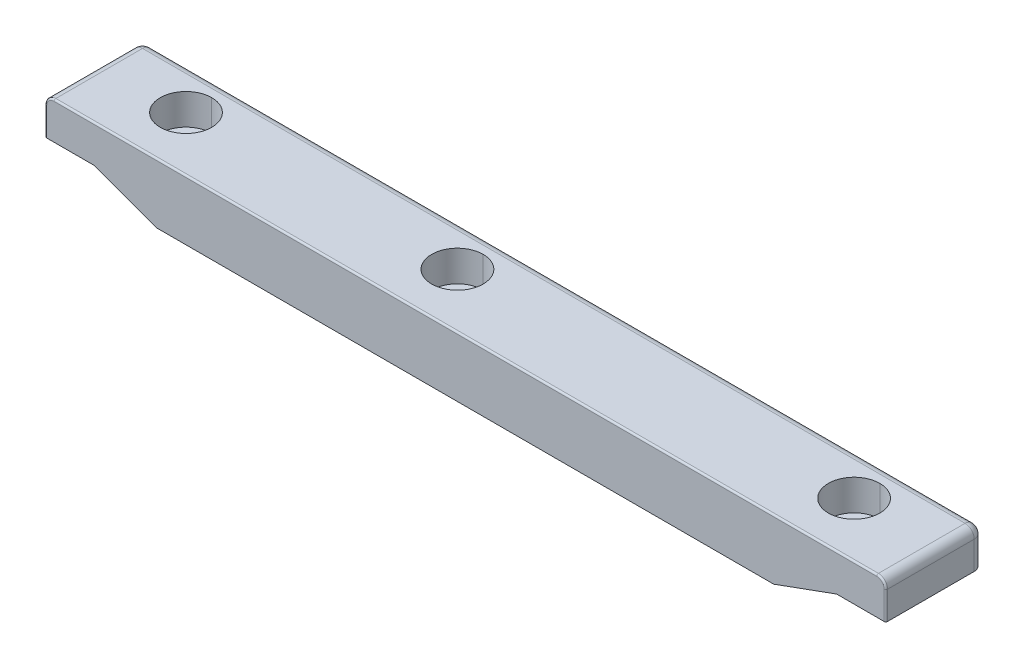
ISO-10303-21;
HEADER;
FILE_DESCRIPTION(('STEP AP214'),'2;1');
FILE_NAME('part.step','',(''),(''),'','','');
FILE_SCHEMA(('AUTOMOTIVE_DESIGN { 1 0 10303 214 1 1 1 1 }'));
ENDSEC;
DATA;
#1=APPLICATION_CONTEXT('core data for automotive mechanical design processes');
#2=APPLICATION_PROTOCOL_DEFINITION('international standard','automotive_design',2000,#1);
#3=PRODUCT_CONTEXT('',#1,'mechanical');
#4=PRODUCT('Part','Part','',(#3));
#5=PRODUCT_RELATED_PRODUCT_CATEGORY('part','',(#4));
#6=PRODUCT_DEFINITION_FORMATION('','',#4);
#7=PRODUCT_DEFINITION_CONTEXT('part definition',#1,'design');
#8=PRODUCT_DEFINITION('design','',#6,#7);
#9=PRODUCT_DEFINITION_SHAPE('','',#8);
#10=(LENGTH_UNIT() NAMED_UNIT(*) SI_UNIT(.MILLI.,.METRE.));
#11=(NAMED_UNIT(*) PLANE_ANGLE_UNIT() SI_UNIT($,.RADIAN.));
#12=(NAMED_UNIT(*) SI_UNIT($,.STERADIAN.) SOLID_ANGLE_UNIT());
#13=UNCERTAINTY_MEASURE_WITH_UNIT(LENGTH_MEASURE(1.E-05),#10,'distance_accuracy_value','');
#14=(GEOMETRIC_REPRESENTATION_CONTEXT(3) GLOBAL_UNCERTAINTY_ASSIGNED_CONTEXT((#13)) GLOBAL_UNIT_ASSIGNED_CONTEXT((#10,
#11,#12)) REPRESENTATION_CONTEXT('',''));
#15=CARTESIAN_POINT('',(0.,0.,0.));
#16=DIRECTION('',(0.,0.,1.));
#17=DIRECTION('',(1.,0.,0.));
#18=AXIS2_PLACEMENT_3D('',#15,#16,#17);
#19=CARTESIAN_POINT('',(-58.4,29.,7.5));
#20=DIRECTION('',(0.,1.,0.));
#21=DIRECTION('',(0.,0.,1.));
#22=AXIS2_PLACEMENT_3D('',#19,#20,#21);
#23=CYLINDRICAL_SURFACE('',#22,4.5);
#24=DIRECTION('',(0.,1.,0.));
#25=VECTOR('',#24,1.);
#26=CARTESIAN_POINT('',(-58.4,29.,3.));
#27=LINE('',#26,#25);
#28=CARTESIAN_POINT('',(-58.4,23.6,3.));
#29=VERTEX_POINT('',#28);
#30=CARTESIAN_POINT('',(-58.4,29.,3.));
#31=VERTEX_POINT('',#30);
#32=EDGE_CURVE('E587',#29,#31,#27,.T.);
#33=ORIENTED_EDGE('',*,*,#32,.F.);
#34=CARTESIAN_POINT('',(-58.4,23.6,7.5));
#35=DIRECTION('',(0.,1.,0.));
#36=DIRECTION('',(0.,0.,1.));
#37=AXIS2_PLACEMENT_3D('',#34,#35,#36);
#38=CIRCLE('',#37,4.5);
#39=CARTESIAN_POINT('',(-58.4,23.6,12.));
#40=VERTEX_POINT('',#39);
#41=EDGE_CURVE('E10',#40,#29,#38,.T.);
#42=ORIENTED_EDGE('',*,*,#41,.F.);
#43=DIRECTION('',(0.,1.,0.));
#44=VECTOR('',#43,1.);
#45=CARTESIAN_POINT('',(-58.4,29.,12.));
#46=LINE('',#45,#44);
#47=CARTESIAN_POINT('',(-58.4,29.,12.));
#48=VERTEX_POINT('',#47);
#49=EDGE_CURVE('E488',#40,#48,#46,.T.);
#50=ORIENTED_EDGE('',*,*,#49,.T.);
#51=CARTESIAN_POINT('',(-58.4,29.,7.5));
#52=DIRECTION('',(0.,1.,0.));
#53=DIRECTION('',(0.,0.,1.));
#54=AXIS2_PLACEMENT_3D('',#51,#52,#53);
#55=CIRCLE('',#54,4.5);
#56=EDGE_CURVE('E321',#48,#31,#55,.T.);
#57=ORIENTED_EDGE('',*,*,#56,.T.);
#58=EDGE_LOOP('',(#33,#42,#50,#57));
#59=FACE_BOUND('',#58,.T.);
#60=ADVANCED_FACE('F15',(#59),#23,.F.);
#61=CARTESIAN_POINT('',(-55.65,23.6,7.5));
#62=DIRECTION('',(0.,-1.,0.));
#63=DIRECTION('',(0.,0.,-1.));
#64=AXIS2_PLACEMENT_3D('',#61,#62,#63);
#65=PLANE('',#64);
#66=CARTESIAN_POINT('',(-58.4,23.6,7.5));
#67=DIRECTION('',(0.,1.,0.));
#68=DIRECTION('',(0.,0.,1.));
#69=AXIS2_PLACEMENT_3D('',#66,#67,#68);
#70=CIRCLE('',#69,2.75);
#71=CARTESIAN_POINT('',(-58.4,23.6,10.25));
#72=VERTEX_POINT('',#71);
#73=CARTESIAN_POINT('',(-58.4,23.6,4.75));
#74=VERTEX_POINT('',#73);
#75=EDGE_CURVE('E19',#72,#74,#70,.T.);
#76=ORIENTED_EDGE('',*,*,#75,.F.);
#77=CARTESIAN_POINT('',(-58.4,23.6,7.5));
#78=DIRECTION('',(0.,1.,0.));
#79=DIRECTION('',(0.,0.,1.));
#80=AXIS2_PLACEMENT_3D('',#77,#78,#79);
#81=CIRCLE('',#80,2.75);
#82=EDGE_CURVE('E475',#74,#72,#81,.T.);
#83=ORIENTED_EDGE('',*,*,#82,.F.);
#84=EDGE_LOOP('',(#76,#83));
#85=FACE_BOUND('',#84,.T.);
#86=ORIENTED_EDGE('',*,*,#41,.T.);
#87=CARTESIAN_POINT('',(-58.4,23.6,7.5));
#88=DIRECTION('',(0.,1.,0.));
#89=DIRECTION('',(0.,0.,1.));
#90=AXIS2_PLACEMENT_3D('',#87,#88,#89);
#91=CIRCLE('',#90,4.5);
#92=EDGE_CURVE('E1088',#29,#40,#91,.T.);
#93=ORIENTED_EDGE('',*,*,#92,.T.);
#94=EDGE_LOOP('',(#86,#93));
#95=FACE_BOUND('',#94,.T.);
#96=ADVANCED_FACE('F17',(#85,#95),#65,.F.);
#97=CARTESIAN_POINT('',(-58.4,29.,7.5));
#98=DIRECTION('',(0.,1.,0.));
#99=DIRECTION('',(0.,0.,1.));
#100=AXIS2_PLACEMENT_3D('',#97,#98,#99);
#101=CYLINDRICAL_SURFACE('',#100,2.75);
#102=DIRECTION('',(0.,1.,0.));
#103=VECTOR('',#102,1.);
#104=CARTESIAN_POINT('',(-58.4,29.,4.75));
#105=LINE('',#104,#103);
#106=CARTESIAN_POINT('',(-58.4,20.1484749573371,4.75));
#107=VERTEX_POINT('',#106);
#108=EDGE_CURVE('E469',#107,#74,#105,.T.);
#109=ORIENTED_EDGE('',*,*,#108,.F.);
#110=CARTESIAN_POINT('',(-58.4,20.1484749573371,10.25));
#111=CARTESIAN_POINT('',(-52.9,18.146638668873,10.25));
#112=CARTESIAN_POINT('',(-52.9,18.146638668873,4.75));
#113=CARTESIAN_POINT('',(-58.4,20.1484749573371,4.75));
#114=(BOUNDED_CURVE() B_SPLINE_CURVE(3,(#110,#111,#112,#113),.UNSPECIFIED.,.F.,
.F.) B_SPLINE_CURVE_WITH_KNOTS((4,4),(1.5707963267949,4.71238898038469),
.UNSPECIFIED.) CURVE() GEOMETRIC_REPRESENTATION_ITEM() RATIONAL_B_SPLINE_CURVE((1.,
0.333333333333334,0.333333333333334,1.)) REPRESENTATION_ITEM(''));
#115=CARTESIAN_POINT('',(-58.4,20.1484749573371,10.25));
#116=VERTEX_POINT('',#115);
#117=EDGE_CURVE('E430',#116,#107,#114,.T.);
#118=ORIENTED_EDGE('',*,*,#117,.F.);
#119=DIRECTION('',(0.,1.,0.));
#120=VECTOR('',#119,1.);
#121=CARTESIAN_POINT('',(-58.4,29.,10.25));
#122=LINE('',#121,#120);
#123=EDGE_CURVE('E472',#116,#72,#122,.T.);
#124=ORIENTED_EDGE('',*,*,#123,.T.);
#125=ORIENTED_EDGE('',*,*,#75,.T.);
#126=EDGE_LOOP('',(#109,#118,#124,#125));
#127=FACE_BOUND('',#126,.T.);
#128=ADVANCED_FACE('F467',(#127),#101,.F.);
#129=CARTESIAN_POINT('',(-10.95,29.,7.5));
#130=DIRECTION('',(0.,1.,0.));
#131=DIRECTION('',(0.,0.,1.));
#132=AXIS2_PLACEMENT_3D('',#129,#130,#131);
#133=CYLINDRICAL_SURFACE('',#132,4.5);
#134=DIRECTION('',(0.,1.,0.));
#135=VECTOR('',#134,1.);
#136=CARTESIAN_POINT('',(-10.95,29.,3.));
#137=LINE('',#136,#135);
#138=CARTESIAN_POINT('',(-10.95,23.6,3.));
#139=VERTEX_POINT('',#138);
#140=CARTESIAN_POINT('',(-10.95,29.,3.));
#141=VERTEX_POINT('',#140);
#142=EDGE_CURVE('E516',#139,#141,#137,.T.);
#143=ORIENTED_EDGE('',*,*,#142,.F.);
#144=CARTESIAN_POINT('',(-10.95,23.6,7.5));
#145=DIRECTION('',(0.,1.,0.));
#146=DIRECTION('',(0.,0.,1.));
#147=AXIS2_PLACEMENT_3D('',#144,#145,#146);
#148=CIRCLE('',#147,4.5);
#149=CARTESIAN_POINT('',(-10.95,23.6,12.));
#150=VERTEX_POINT('',#149);
#151=EDGE_CURVE('E453',#150,#139,#148,.T.);
#152=ORIENTED_EDGE('',*,*,#151,.F.);
#153=DIRECTION('',(0.,1.,0.));
#154=VECTOR('',#153,1.);
#155=CARTESIAN_POINT('',(-10.95,29.,12.));
#156=LINE('',#155,#154);
#157=CARTESIAN_POINT('',(-10.95,29.,12.));
#158=VERTEX_POINT('',#157);
#159=EDGE_CURVE('E519',#150,#158,#156,.T.);
#160=ORIENTED_EDGE('',*,*,#159,.T.);
#161=CARTESIAN_POINT('',(-10.95,29.,7.5));
#162=DIRECTION('',(0.,1.,0.));
#163=DIRECTION('',(0.,0.,1.));
#164=AXIS2_PLACEMENT_3D('',#161,#162,#163);
#165=CIRCLE('',#164,4.5);
#166=EDGE_CURVE('E328',#158,#141,#165,.T.);
#167=ORIENTED_EDGE('',*,*,#166,.T.);
#168=EDGE_LOOP('',(#143,#152,#160,#167));
#169=FACE_BOUND('',#168,.T.);
#170=ADVANCED_FACE('F756',(#169),#133,.F.);
#171=CARTESIAN_POINT('',(-8.2,23.6,7.5));
#172=DIRECTION('',(0.,-1.,0.));
#173=DIRECTION('',(0.,0.,-1.));
#174=AXIS2_PLACEMENT_3D('',#171,#172,#173);
#175=PLANE('',#174);
#176=CARTESIAN_POINT('',(-10.95,23.6,7.5));
#177=DIRECTION('',(0.,1.,0.));
#178=DIRECTION('',(0.,0.,1.));
#179=AXIS2_PLACEMENT_3D('',#176,#177,#178);
#180=CIRCLE('',#179,2.75);
#181=CARTESIAN_POINT('',(-10.95,23.6,10.25));
#182=VERTEX_POINT('',#181);
#183=CARTESIAN_POINT('',(-10.95,23.6,4.75));
#184=VERTEX_POINT('',#183);
#185=EDGE_CURVE('E448',#182,#184,#180,.T.);
#186=ORIENTED_EDGE('',*,*,#185,.F.);
#187=CARTESIAN_POINT('',(-10.95,23.6,7.5));
#188=DIRECTION('',(0.,1.,0.));
#189=DIRECTION('',(0.,0.,1.));
#190=AXIS2_PLACEMENT_3D('',#187,#188,#189);
#191=CIRCLE('',#190,2.75);
#192=EDGE_CURVE('E499',#184,#182,#191,.T.);
#193=ORIENTED_EDGE('',*,*,#192,.F.);
#194=EDGE_LOOP('',(#186,#193));
#195=FACE_BOUND('',#194,.T.);
#196=ORIENTED_EDGE('',*,*,#151,.T.);
#197=CARTESIAN_POINT('',(-10.95,23.6,7.5));
#198=DIRECTION('',(0.,1.,0.));
#199=DIRECTION('',(0.,0.,1.));
#200=AXIS2_PLACEMENT_3D('',#197,#198,#199);
#201=CIRCLE('',#200,4.5);
#202=EDGE_CURVE('E510',#139,#150,#201,.T.);
#203=ORIENTED_EDGE('',*,*,#202,.T.);
#204=EDGE_LOOP('',(#196,#203));
#205=FACE_BOUND('',#204,.T.);
#206=ADVANCED_FACE('F754',(#195,#205),#175,.F.);
#207=CARTESIAN_POINT('',(-10.95,29.,7.5));
#208=DIRECTION('',(0.,1.,0.));
#209=DIRECTION('',(0.,0.,1.));
#210=AXIS2_PLACEMENT_3D('',#207,#208,#209);
#211=CYLINDRICAL_SURFACE('',#210,2.75);
#212=DIRECTION('',(0.,1.,0.));
#213=VECTOR('',#212,1.);
#214=CARTESIAN_POINT('',(-10.95,29.,4.75));
#215=LINE('',#214,#213);
#216=CARTESIAN_POINT('',(-10.95,18.51,4.75));
#217=VERTEX_POINT('',#216);
#218=EDGE_CURVE('E495',#217,#184,#215,.T.);
#219=ORIENTED_EDGE('',*,*,#218,.F.);
#220=CARTESIAN_POINT('',(-10.95,18.51,7.5));
#221=DIRECTION('',(0.,1.,0.));
#222=DIRECTION('',(0.,0.,1.));
#223=AXIS2_PLACEMENT_3D('',#220,#221,#222);
#224=CIRCLE('',#223,2.75);
#225=CARTESIAN_POINT('',(-10.95,18.51,10.25));
#226=VERTEX_POINT('',#225);
#227=EDGE_CURVE('E441',#226,#217,#224,.T.);
#228=ORIENTED_EDGE('',*,*,#227,.F.);
#229=DIRECTION('',(0.,1.,0.));
#230=VECTOR('',#229,1.);
#231=CARTESIAN_POINT('',(-10.95,29.,10.25));
#232=LINE('',#231,#230);
#233=EDGE_CURVE('E507',#226,#182,#232,.T.);
#234=ORIENTED_EDGE('',*,*,#233,.T.);
#235=ORIENTED_EDGE('',*,*,#185,.T.);
#236=EDGE_LOOP('',(#219,#228,#234,#235));
#237=FACE_BOUND('',#236,.T.);
#238=ADVANCED_FACE('F750',(#237),#211,.F.);
#239=CARTESIAN_POINT('',(58.4,29.,7.5));
#240=DIRECTION('',(0.,1.,0.));
#241=DIRECTION('',(0.,0.,1.));
#242=AXIS2_PLACEMENT_3D('',#239,#240,#241);
#243=CYLINDRICAL_SURFACE('',#242,4.5);
#244=DIRECTION('',(0.,1.,0.));
#245=VECTOR('',#244,1.);
#246=CARTESIAN_POINT('',(58.4,29.,3.));
#247=LINE('',#246,#245);
#248=CARTESIAN_POINT('',(58.4,23.6,3.));
#249=VERTEX_POINT('',#248);
#250=CARTESIAN_POINT('',(58.4,29.,3.));
#251=VERTEX_POINT('',#250);
#252=EDGE_CURVE('E534',#249,#251,#247,.T.);
#253=ORIENTED_EDGE('',*,*,#252,.F.);
#254=CARTESIAN_POINT('',(58.4,23.6,7.5));
#255=DIRECTION('',(0.,1.,0.));
#256=DIRECTION('',(0.,0.,1.));
#257=AXIS2_PLACEMENT_3D('',#254,#255,#256);
#258=CIRCLE('',#257,4.5);
#259=CARTESIAN_POINT('',(58.4,23.6,12.));
#260=VERTEX_POINT('',#259);
#261=EDGE_CURVE('E391',#260,#249,#258,.T.);
#262=ORIENTED_EDGE('',*,*,#261,.F.);
#263=DIRECTION('',(0.,1.,0.));
#264=VECTOR('',#263,1.);
#265=CARTESIAN_POINT('',(58.4,29.,12.));
#266=LINE('',#265,#264);
#267=CARTESIAN_POINT('',(58.4,29.,12.));
#268=VERTEX_POINT('',#267);
#269=EDGE_CURVE('E545',#260,#268,#266,.T.);
#270=ORIENTED_EDGE('',*,*,#269,.T.);
#271=CARTESIAN_POINT('',(58.4,29.,7.5));
#272=DIRECTION('',(0.,1.,0.));
#273=DIRECTION('',(0.,0.,1.));
#274=AXIS2_PLACEMENT_3D('',#271,#272,#273);
#275=CIRCLE('',#274,4.5);
#276=EDGE_CURVE('E332',#268,#251,#275,.T.);
#277=ORIENTED_EDGE('',*,*,#276,.T.);
#278=EDGE_LOOP('',(#253,#262,#270,#277));
#279=FACE_BOUND('',#278,.T.);
#280=ADVANCED_FACE('F700',(#279),#243,.F.);
#281=CARTESIAN_POINT('',(61.15,23.6,7.5));
#282=DIRECTION('',(0.,-1.,0.));
#283=DIRECTION('',(0.,0.,-1.));
#284=AXIS2_PLACEMENT_3D('',#281,#282,#283);
#285=PLANE('',#284);
#286=CARTESIAN_POINT('',(58.4,23.6,7.5));
#287=DIRECTION('',(0.,1.,0.));
#288=DIRECTION('',(0.,0.,1.));
#289=AXIS2_PLACEMENT_3D('',#286,#287,#288);
#290=CIRCLE('',#289,2.75);
#291=CARTESIAN_POINT('',(58.4,23.6,10.25));
#292=VERTEX_POINT('',#291);
#293=CARTESIAN_POINT('',(58.4,23.6,4.75));
#294=VERTEX_POINT('',#293);
#295=EDGE_CURVE('E388',#292,#294,#290,.T.);
#296=ORIENTED_EDGE('',*,*,#295,.F.);
#297=CARTESIAN_POINT('',(58.4,23.6,7.5));
#298=DIRECTION('',(0.,1.,0.));
#299=DIRECTION('',(0.,0.,1.));
#300=AXIS2_PLACEMENT_3D('',#297,#298,#299);
#301=CIRCLE('',#300,2.75);
#302=EDGE_CURVE('E279',#294,#292,#301,.T.);
#303=ORIENTED_EDGE('',*,*,#302,.F.);
#304=EDGE_LOOP('',(#296,#303));
#305=FACE_BOUND('',#304,.T.);
#306=ORIENTED_EDGE('',*,*,#261,.T.);
#307=CARTESIAN_POINT('',(58.4,23.6,7.5));
#308=DIRECTION('',(0.,1.,0.));
#309=DIRECTION('',(0.,0.,1.));
#310=AXIS2_PLACEMENT_3D('',#307,#308,#309);
#311=CIRCLE('',#310,4.5);
#312=EDGE_CURVE('E530',#249,#260,#311,.T.);
#313=ORIENTED_EDGE('',*,*,#312,.T.);
#314=EDGE_LOOP('',(#306,#313));
#315=FACE_BOUND('',#314,.T.);
#316=ADVANCED_FACE('F564',(#305,#315),#285,.F.);
#317=CARTESIAN_POINT('',(58.4,29.,7.5));
#318=DIRECTION('',(0.,1.,0.));
#319=DIRECTION('',(0.,0.,1.));
#320=AXIS2_PLACEMENT_3D('',#317,#318,#319);
#321=CYLINDRICAL_SURFACE('',#320,2.75);
#322=DIRECTION('',(0.,1.,0.));
#323=VECTOR('',#322,1.);
#324=CARTESIAN_POINT('',(58.4,29.,4.75));
#325=LINE('',#324,#323);
#326=CARTESIAN_POINT('',(58.4,20.1484749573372,4.75));
#327=VERTEX_POINT('',#326);
#328=EDGE_CURVE('E550',#327,#294,#325,.T.);
#329=ORIENTED_EDGE('',*,*,#328,.F.);
#330=CARTESIAN_POINT('',(58.4,20.1484749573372,10.25));
#331=CARTESIAN_POINT('',(63.9,22.1503112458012,10.25));
#332=CARTESIAN_POINT('',(63.9,22.1503112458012,4.74999999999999));
#333=CARTESIAN_POINT('',(58.4,20.1484749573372,4.75));
#334=(BOUNDED_CURVE() B_SPLINE_CURVE(3,(#330,#331,#332,#333),.UNSPECIFIED.,.F.,
.F.) B_SPLINE_CURVE_WITH_KNOTS((4,4),(4.71238898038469,7.85398163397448),
.UNSPECIFIED.) CURVE() GEOMETRIC_REPRESENTATION_ITEM() RATIONAL_B_SPLINE_CURVE((1.,
0.333333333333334,0.333333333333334,1.)) REPRESENTATION_ITEM(''));
#335=CARTESIAN_POINT('',(58.4,20.1484749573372,10.25));
#336=VERTEX_POINT('',#335);
#337=EDGE_CURVE('E392',#336,#327,#334,.T.);
#338=ORIENTED_EDGE('',*,*,#337,.F.);
#339=DIRECTION('',(0.,1.,0.));
#340=VECTOR('',#339,1.);
#341=CARTESIAN_POINT('',(58.4,29.,10.25));
#342=LINE('',#341,#340);
#343=EDGE_CURVE('E273',#336,#292,#342,.T.);
#344=ORIENTED_EDGE('',*,*,#343,.T.);
#345=ORIENTED_EDGE('',*,*,#295,.T.);
#346=EDGE_LOOP('',(#329,#338,#344,#345));
#347=FACE_BOUND('',#346,.T.);
#348=ADVANCED_FACE('F567',(#347),#321,.F.);
#349=CARTESIAN_POINT('',(64.8865797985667,22.5093969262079,17.05));
#350=DIRECTION('',(-0.342020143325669,0.939692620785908,0.));
#351=DIRECTION('',(0.,0.,1.));
#352=AXIS2_PLACEMENT_3D('',#349,#350,#351);
#353=PLANE('',#352);
#354=ORIENTED_EDGE('',*,*,#337,.T.);
#355=CARTESIAN_POINT('',(58.4,20.1484749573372,4.75));
#356=CARTESIAN_POINT('',(52.9,18.146638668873,4.74999999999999));
#357=CARTESIAN_POINT('',(52.9,18.146638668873,10.25));
#358=CARTESIAN_POINT('',(58.4,20.1484749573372,10.25));
#359=(BOUNDED_CURVE() B_SPLINE_CURVE(3,(#355,#356,#357,#358),.UNSPECIFIED.,.F.,
.F.) B_SPLINE_CURVE_WITH_KNOTS((4,4),(1.5707963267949,4.71238898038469),
.UNSPECIFIED.) CURVE() GEOMETRIC_REPRESENTATION_ITEM() RATIONAL_B_SPLINE_CURVE((1.,
0.333333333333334,0.333333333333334,1.)) REPRESENTATION_ITEM(''));
#360=EDGE_CURVE('E549',#327,#336,#359,.T.);
#361=ORIENTED_EDGE('',*,*,#360,.T.);
#362=EDGE_LOOP('',(#354,#361));
#363=FACE_BOUND('',#362,.T.);
#364=DIRECTION('',(0.939692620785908,0.342020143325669,0.));
#365=VECTOR('',#364,1.);
#366=CARTESIAN_POINT('',(64.8865797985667,22.5093969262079,0.));
#367=LINE('',#366,#365);
#368=CARTESIAN_POINT('',(53.8983270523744,18.51,0.));
#369=VERTEX_POINT('',#368);
#370=CARTESIAN_POINT('',(64.8882367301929,22.51,0.));
#371=VERTEX_POINT('',#370);
#372=EDGE_CURVE('E387',#369,#371,#367,.T.);
#373=ORIENTED_EDGE('',*,*,#372,.T.);
#374=DIRECTION('',(0.,0.,-1.));
#375=VECTOR('',#374,1.);
#376=CARTESIAN_POINT('',(64.8882367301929,22.51,17.05));
#377=LINE('',#376,#375);
#378=CARTESIAN_POINT('',(64.8882367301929,22.51,17.05));
#379=VERTEX_POINT('',#378);
#380=EDGE_CURVE('E352',#379,#371,#377,.T.);
#381=ORIENTED_EDGE('',*,*,#380,.F.);
#382=DIRECTION('',(0.939692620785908,0.342020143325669,0.));
#383=VECTOR('',#382,1.);
#384=CARTESIAN_POINT('',(64.8865797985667,22.5093969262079,17.05));
#385=LINE('',#384,#383);
#386=CARTESIAN_POINT('',(53.8983270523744,18.51,17.05));
#387=VERTEX_POINT('',#386);
#388=EDGE_CURVE('E339',#387,#379,#385,.T.);
#389=ORIENTED_EDGE('',*,*,#388,.F.);
#390=DIRECTION('',(0.,0.,-1.));
#391=VECTOR('',#390,1.);
#392=CARTESIAN_POINT('',(53.8983270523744,18.51,17.05));
#393=LINE('',#392,#391);
#394=EDGE_CURVE('E435',#387,#369,#393,.T.);
#395=ORIENTED_EDGE('',*,*,#394,.T.);
#396=EDGE_LOOP('',(#373,#381,#389,#395));
#397=FACE_BOUND('',#396,.T.);
#398=ADVANCED_FACE('F569',(#363,#397),#353,.F.);
#399=CARTESIAN_POINT('',(53.9000903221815,18.51,17.05));
#400=DIRECTION('',(0.,1.,0.));
#401=DIRECTION('',(1.,0.,0.));
#402=AXIS2_PLACEMENT_3D('',#399,#400,#401);
#403=PLANE('',#402);
#404=ORIENTED_EDGE('',*,*,#227,.T.);
#405=CARTESIAN_POINT('',(-10.95,18.51,7.5));
#406=DIRECTION('',(0.,1.,0.));
#407=DIRECTION('',(0.,0.,1.));
#408=AXIS2_PLACEMENT_3D('',#405,#406,#407);
#409=CIRCLE('',#408,2.75);
#410=EDGE_CURVE('E500',#217,#226,#409,.T.);
#411=ORIENTED_EDGE('',*,*,#410,.T.);
#412=EDGE_LOOP('',(#404,#411));
#413=FACE_BOUND('',#412,.T.);
#414=DIRECTION('',(1.,0.,0.));
#415=VECTOR('',#414,1.);
#416=CARTESIAN_POINT('',(53.9000903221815,18.51,0.));
#417=LINE('',#416,#415);
#418=CARTESIAN_POINT('',(-53.8983270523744,18.51,0.));
#419=VERTEX_POINT('',#418);
#420=EDGE_CURVE('E396',#419,#369,#417,.T.);
#421=ORIENTED_EDGE('',*,*,#420,.T.);
#422=ORIENTED_EDGE('',*,*,#394,.F.);
#423=DIRECTION('',(1.,0.,0.));
#424=VECTOR('',#423,1.);
#425=CARTESIAN_POINT('',(53.9000903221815,18.51,17.05));
#426=LINE('',#425,#424);
#427=CARTESIAN_POINT('',(-53.8983270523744,18.51,17.05));
#428=VERTEX_POINT('',#427);
#429=EDGE_CURVE('E379',#428,#387,#426,.T.);
#430=ORIENTED_EDGE('',*,*,#429,.F.);
#431=DIRECTION('',(0.,0.,-1.));
#432=VECTOR('',#431,1.);
#433=CARTESIAN_POINT('',(-53.8983270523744,18.51,17.05));
#434=LINE('',#433,#432);
#435=EDGE_CURVE('E135',#428,#419,#434,.T.);
#436=ORIENTED_EDGE('',*,*,#435,.T.);
#437=EDGE_LOOP('',(#421,#422,#430,#436));
#438=FACE_BOUND('',#437,.T.);
#439=ADVANCED_FACE('F741',(#413,#438),#403,.F.);
#440=CARTESIAN_POINT('',(-64.8865797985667,22.5093969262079,17.05));
#441=DIRECTION('',(0.342020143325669,0.939692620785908,0.));
#442=DIRECTION('',(0.,0.,-1.));
#443=AXIS2_PLACEMENT_3D('',#440,#441,#442);
#444=PLANE('',#443);
#445=ORIENTED_EDGE('',*,*,#117,.T.);
#446=CARTESIAN_POINT('',(-58.4,20.1484749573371,4.75));
#447=CARTESIAN_POINT('',(-63.9,22.1503112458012,4.75));
#448=CARTESIAN_POINT('',(-63.9,22.1503112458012,10.25));
#449=CARTESIAN_POINT('',(-58.4,20.1484749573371,10.25));
#450=(BOUNDED_CURVE() B_SPLINE_CURVE(3,(#446,#447,#448,#449),.UNSPECIFIED.,.F.,
.F.) B_SPLINE_CURVE_WITH_KNOTS((4,4),(4.71238898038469,7.85398163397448),
.UNSPECIFIED.) CURVE() GEOMETRIC_REPRESENTATION_ITEM() RATIONAL_B_SPLINE_CURVE((1.,
0.333333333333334,0.333333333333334,1.)) REPRESENTATION_ITEM(''));
#451=EDGE_CURVE('E482',#107,#116,#450,.T.);
#452=ORIENTED_EDGE('',*,*,#451,.T.);
#453=EDGE_LOOP('',(#445,#452));
#454=FACE_BOUND('',#453,.T.);
#455=DIRECTION('',(0.939692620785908,-0.342020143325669,0.));
#456=VECTOR('',#455,1.);
#457=CARTESIAN_POINT('',(-64.8865797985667,22.5093969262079,0.));
#458=LINE('',#457,#456);
#459=CARTESIAN_POINT('',(-64.8882367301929,22.51,0.));
#460=VERTEX_POINT('',#459);
#461=EDGE_CURVE('E399',#460,#419,#458,.T.);
#462=ORIENTED_EDGE('',*,*,#461,.T.);
#463=ORIENTED_EDGE('',*,*,#435,.F.);
#464=DIRECTION('',(0.939692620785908,-0.342020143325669,0.));
#465=VECTOR('',#464,1.);
#466=CARTESIAN_POINT('',(-64.8865797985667,22.5093969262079,17.05));
#467=LINE('',#466,#465);
#468=CARTESIAN_POINT('',(-64.8882367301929,22.51,17.05));
#469=VERTEX_POINT('',#468);
#470=EDGE_CURVE('E375',#469,#428,#467,.T.);
#471=ORIENTED_EDGE('',*,*,#470,.F.);
#472=DIRECTION('',(0.,0.,-1.));
#473=VECTOR('',#472,1.);
#474=CARTESIAN_POINT('',(-64.8882367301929,22.51,17.05));
#475=LINE('',#474,#473);
#476=EDGE_CURVE('E145',#469,#460,#475,.T.);
#477=ORIENTED_EDGE('',*,*,#476,.T.);
#478=EDGE_LOOP('',(#462,#463,#471,#477));
#479=FACE_BOUND('',#478,.T.);
#480=ADVANCED_FACE('F668',(#454,#479),#444,.F.);
#481=CARTESIAN_POINT('',(-73.5,22.51,17.05));
#482=DIRECTION('',(0.,1.,0.));
#483=DIRECTION('',(1.,0.,0.));
#484=AXIS2_PLACEMENT_3D('',#481,#482,#483);
#485=PLANE('',#484);
#486=CARTESIAN_POINT('',(-71.9,22.51,1.6));
#487=DIRECTION('',(0.,-1.,0.));
#488=DIRECTION('',(0.,0.,1.));
#489=AXIS2_PLACEMENT_3D('',#486,#487,#488);
#490=CIRCLE('',#489,1.6);
#491=CARTESIAN_POINT('',(-73.5,22.51,1.6));
#492=VERTEX_POINT('',#491);
#493=CARTESIAN_POINT('',(-71.9,22.51,0.));
#494=VERTEX_POINT('',#493);
#495=EDGE_CURVE('E245',#492,#494,#490,.T.);
#496=ORIENTED_EDGE('',*,*,#495,.T.);
#497=DIRECTION('',(1.,0.,0.));
#498=VECTOR('',#497,1.);
#499=CARTESIAN_POINT('',(-73.5,22.51,0.));
#500=LINE('',#499,#498);
#501=EDGE_CURVE('E402',#494,#460,#500,.T.);
#502=ORIENTED_EDGE('',*,*,#501,.T.);
#503=ORIENTED_EDGE('',*,*,#476,.F.);
#504=DIRECTION('',(1.,0.,0.));
#505=VECTOR('',#504,1.);
#506=CARTESIAN_POINT('',(-73.5,22.51,17.05));
#507=LINE('',#506,#505);
#508=CARTESIAN_POINT('',(-73.2,22.51,17.05));
#509=VERTEX_POINT('',#508);
#510=EDGE_CURVE('E371',#509,#469,#507,.T.);
#511=ORIENTED_EDGE('',*,*,#510,.F.);
#512=CARTESIAN_POINT('',(-73.2,22.51,16.75));
#513=DIRECTION('',(0.,-1.,0.));
#514=DIRECTION('',(0.,0.,1.));
#515=AXIS2_PLACEMENT_3D('',#512,#513,#514);
#516=CIRCLE('',#515,0.3);
#517=CARTESIAN_POINT('',(-73.5,22.51,16.75));
#518=VERTEX_POINT('',#517);
#519=EDGE_CURVE('E261',#509,#518,#516,.T.);
#520=ORIENTED_EDGE('',*,*,#519,.T.);
#521=DIRECTION('',(0.,0.,-1.));
#522=VECTOR('',#521,1.);
#523=CARTESIAN_POINT('',(-73.5,22.51,17.05));
#524=LINE('',#523,#522);
#525=EDGE_CURVE('E258',#518,#492,#524,.T.);
#526=ORIENTED_EDGE('',*,*,#525,.T.);
#527=EDGE_LOOP('',(#496,#502,#503,#511,#520,#526));
#528=FACE_BOUND('',#527,.T.);
#529=ADVANCED_FACE('F259',(#528),#485,.F.);
#530=CARTESIAN_POINT('',(73.5,22.51,17.05));
#531=DIRECTION('',(0.,1.,0.));
#532=DIRECTION('',(1.,0.,0.));
#533=AXIS2_PLACEMENT_3D('',#530,#531,#532);
#534=PLANE('',#533);
#535=CARTESIAN_POINT('',(71.9,22.51,1.6));
#536=DIRECTION('',(0.,-1.,0.));
#537=DIRECTION('',(0.,0.,1.));
#538=AXIS2_PLACEMENT_3D('',#535,#536,#537);
#539=CIRCLE('',#538,1.6);
#540=CARTESIAN_POINT('',(71.9,22.51,0.));
#541=VERTEX_POINT('',#540);
#542=CARTESIAN_POINT('',(73.5,22.51,1.6));
#543=VERTEX_POINT('',#542);
#544=EDGE_CURVE('E322',#541,#543,#539,.T.);
#545=ORIENTED_EDGE('',*,*,#544,.T.);
#546=DIRECTION('',(0.,0.,-1.));
#547=VECTOR('',#546,1.);
#548=CARTESIAN_POINT('',(73.5,22.51,17.05));
#549=LINE('',#548,#547);
#550=CARTESIAN_POINT('',(73.5,22.51,16.75));
#551=VERTEX_POINT('',#550);
#552=EDGE_CURVE('E299',#551,#543,#549,.T.);
#553=ORIENTED_EDGE('',*,*,#552,.F.);
#554=CARTESIAN_POINT('',(73.2,22.51,16.75));
#555=DIRECTION('',(0.,-1.,0.));
#556=DIRECTION('',(0.,0.,1.));
#557=AXIS2_PLACEMENT_3D('',#554,#555,#556);
#558=CIRCLE('',#557,0.3);
#559=CARTESIAN_POINT('',(73.2,22.51,17.05));
#560=VERTEX_POINT('',#559);
#561=EDGE_CURVE('E340',#551,#560,#558,.T.);
#562=ORIENTED_EDGE('',*,*,#561,.T.);
#563=DIRECTION('',(1.,0.,0.));
#564=VECTOR('',#563,1.);
#565=CARTESIAN_POINT('',(73.5,22.51,17.05));
#566=LINE('',#565,#564);
#567=EDGE_CURVE('E344',#379,#560,#566,.T.);
#568=ORIENTED_EDGE('',*,*,#567,.F.);
#569=ORIENTED_EDGE('',*,*,#380,.T.);
#570=DIRECTION('',(1.,0.,0.));
#571=VECTOR('',#570,1.);
#572=CARTESIAN_POINT('',(73.5,22.51,0.));
#573=LINE('',#572,#571);
#574=EDGE_CURVE('E383',#371,#541,#573,.T.);
#575=ORIENTED_EDGE('',*,*,#574,.T.);
#576=EDGE_LOOP('',(#545,#553,#562,#568,#569,#575));
#577=FACE_BOUND('',#576,.T.);
#578=ADVANCED_FACE('F643',(#577),#534,.F.);
#579=CARTESIAN_POINT('',(71.9,27.4,16.75));
#580=DIRECTION('',(0.,0.,-1.));
#581=DIRECTION('',(-1.,0.,0.));
#582=AXIS2_PLACEMENT_3D('',#579,#580,#581);
#583=TOROIDAL_SURFACE('',#582,1.3,0.3);
#584=CARTESIAN_POINT('',(73.2,27.4,16.75));
#585=DIRECTION('',(0.,1.,0.));
#586=DIRECTION('',(0.,0.,1.));
#587=AXIS2_PLACEMENT_3D('',#584,#585,#586);
#588=CIRCLE('',#587,0.3);
#589=CARTESIAN_POINT('',(73.2,27.4,17.05));
#590=VERTEX_POINT('',#589);
#591=CARTESIAN_POINT('',(73.5,27.4,16.75));
#592=VERTEX_POINT('',#591);
#593=EDGE_CURVE('E343',#590,#592,#588,.T.);
#594=ORIENTED_EDGE('',*,*,#593,.T.);
#595=CARTESIAN_POINT('',(71.9,27.4,16.75));
#596=DIRECTION('',(0.,0.,-1.));
#597=DIRECTION('',(-1.,0.,0.));
#598=AXIS2_PLACEMENT_3D('',#595,#596,#597);
#599=CIRCLE('',#598,1.6);
#600=CARTESIAN_POINT('',(71.9,29.,16.75));
#601=VERTEX_POINT('',#600);
#602=EDGE_CURVE('E415',#601,#592,#599,.T.);
#603=ORIENTED_EDGE('',*,*,#602,.F.);
#604=CARTESIAN_POINT('',(71.9,28.7,16.75));
#605=DIRECTION('',(1.,0.,0.));
#606=DIRECTION('',(0.,0.,-1.));
#607=AXIS2_PLACEMENT_3D('',#604,#605,#606);
#608=CIRCLE('',#607,0.3);
#609=CARTESIAN_POINT('',(71.9,28.7,17.05));
#610=VERTEX_POINT('',#609);
#611=EDGE_CURVE('E349',#601,#610,#608,.T.);
#612=ORIENTED_EDGE('',*,*,#611,.T.);
#613=CARTESIAN_POINT('',(71.9,27.4,17.05));
#614=DIRECTION('',(0.,0.,1.));
#615=DIRECTION('',(-1.,0.,0.));
#616=AXIS2_PLACEMENT_3D('',#613,#614,#615);
#617=CIRCLE('',#616,1.3);
#618=EDGE_CURVE('E353',#590,#610,#617,.T.);
#619=ORIENTED_EDGE('',*,*,#618,.F.);
#620=EDGE_LOOP('',(#594,#603,#612,#619));
#621=FACE_BOUND('',#620,.T.);
#622=ADVANCED_FACE('F624',(#621),#583,.T.);
#623=CARTESIAN_POINT('',(0.,28.7,16.75));
#624=DIRECTION('',(-1.,0.,0.));
#625=DIRECTION('',(0.,-1.,0.));
#626=AXIS2_PLACEMENT_3D('',#623,#624,#625);
#627=CYLINDRICAL_SURFACE('',#626,0.3);
#628=CARTESIAN_POINT('',(-71.9,28.7,16.75));
#629=DIRECTION('',(1.,0.,0.));
#630=DIRECTION('',(0.,0.,-1.));
#631=AXIS2_PLACEMENT_3D('',#628,#629,#630);
#632=CIRCLE('',#631,0.3);
#633=CARTESIAN_POINT('',(-71.9,29.,16.75));
#634=VERTEX_POINT('',#633);
#635=CARTESIAN_POINT('',(-71.9,28.7,17.05));
#636=VERTEX_POINT('',#635);
#637=EDGE_CURVE('E336',#634,#636,#632,.T.);
#638=ORIENTED_EDGE('',*,*,#637,.T.);
#639=DIRECTION('',(-1.,0.,0.));
#640=VECTOR('',#639,1.);
#641=CARTESIAN_POINT('',(0.,28.7,17.05));
#642=LINE('',#641,#640);
#643=EDGE_CURVE('E357',#610,#636,#642,.T.);
#644=ORIENTED_EDGE('',*,*,#643,.F.);
#645=ORIENTED_EDGE('',*,*,#611,.F.);
#646=DIRECTION('',(1.,0.,0.));
#647=VECTOR('',#646,1.);
#648=CARTESIAN_POINT('',(73.5,29.,16.75));
#649=LINE('',#648,#647);
#650=EDGE_CURVE('E308',#634,#601,#649,.T.);
#651=ORIENTED_EDGE('',*,*,#650,.F.);
#652=EDGE_LOOP('',(#638,#644,#645,#651));
#653=FACE_BOUND('',#652,.T.);
#654=ADVANCED_FACE('F656',(#653),#627,.T.);
#655=CARTESIAN_POINT('',(73.2,0.,16.75));
#656=DIRECTION('',(0.,1.,0.));
#657=DIRECTION('',(-1.,0.,0.));
#658=AXIS2_PLACEMENT_3D('',#655,#656,#657);
#659=CYLINDRICAL_SURFACE('',#658,0.299999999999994);
#660=ORIENTED_EDGE('',*,*,#561,.F.);
#661=DIRECTION('',(0.,-1.,0.));
#662=VECTOR('',#661,1.);
#663=CARTESIAN_POINT('',(73.5,29.,16.75));
#664=LINE('',#663,#662);
#665=EDGE_CURVE('E295',#592,#551,#664,.T.);
#666=ORIENTED_EDGE('',*,*,#665,.F.);
#667=ORIENTED_EDGE('',*,*,#593,.F.);
#668=DIRECTION('',(0.,1.,0.));
#669=VECTOR('',#668,1.);
#670=CARTESIAN_POINT('',(73.2,0.,17.05));
#671=LINE('',#670,#669);
#672=EDGE_CURVE('E348',#560,#590,#671,.T.);
#673=ORIENTED_EDGE('',*,*,#672,.F.);
#674=EDGE_LOOP('',(#660,#666,#667,#673));
#675=FACE_BOUND('',#674,.T.);
#676=ADVANCED_FACE('F639',(#675),#659,.T.);
#677=CARTESIAN_POINT('',(-71.9,27.4,16.75));
#678=DIRECTION('',(0.,0.,-1.));
#679=DIRECTION('',(-1.,0.,0.));
#680=AXIS2_PLACEMENT_3D('',#677,#678,#679);
#681=TOROIDAL_SURFACE('',#680,1.3,0.3);
#682=CARTESIAN_POINT('',(-73.2,27.4,16.75));
#683=DIRECTION('',(0.,1.,0.));
#684=DIRECTION('',(0.,0.,1.));
#685=AXIS2_PLACEMENT_3D('',#682,#683,#684);
#686=CIRCLE('',#685,0.3);
#687=CARTESIAN_POINT('',(-73.5,27.4,16.75));
#688=VERTEX_POINT('',#687);
#689=CARTESIAN_POINT('',(-73.2,27.4,17.05));
#690=VERTEX_POINT('',#689);
#691=EDGE_CURVE('E333',#688,#690,#686,.T.);
#692=ORIENTED_EDGE('',*,*,#691,.T.);
#693=CARTESIAN_POINT('',(-71.9,27.4,17.05));
#694=DIRECTION('',(0.,0.,1.));
#695=DIRECTION('',(-1.,0.,0.));
#696=AXIS2_PLACEMENT_3D('',#693,#694,#695);
#697=CIRCLE('',#696,1.3);
#698=EDGE_CURVE('E361',#636,#690,#697,.T.);
#699=ORIENTED_EDGE('',*,*,#698,.F.);
#700=ORIENTED_EDGE('',*,*,#637,.F.);
#701=CARTESIAN_POINT('',(-71.9,27.4,16.75));
#702=DIRECTION('',(0.,0.,-1.));
#703=DIRECTION('',(-1.,0.,0.));
#704=AXIS2_PLACEMENT_3D('',#701,#702,#703);
#705=CIRCLE('',#704,1.6);
#706=EDGE_CURVE('E290',#688,#634,#705,.T.);
#707=ORIENTED_EDGE('',*,*,#706,.F.);
#708=EDGE_LOOP('',(#692,#699,#700,#707));
#709=FACE_BOUND('',#708,.T.);
#710=ADVANCED_FACE('F675',(#709),#681,.T.);
#711=CARTESIAN_POINT('',(-73.2,0.,16.75));
#712=DIRECTION('',(0.,-1.,0.));
#713=DIRECTION('',(1.,0.,0.));
#714=AXIS2_PLACEMENT_3D('',#711,#712,#713);
#715=CYLINDRICAL_SURFACE('',#714,0.299999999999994);
#716=ORIENTED_EDGE('',*,*,#519,.F.);
#717=DIRECTION('',(0.,-1.,0.));
#718=VECTOR('',#717,1.);
#719=CARTESIAN_POINT('',(-73.2,0.,17.05));
#720=LINE('',#719,#718);
#721=EDGE_CURVE('E365',#690,#509,#720,.T.);
#722=ORIENTED_EDGE('',*,*,#721,.F.);
#723=ORIENTED_EDGE('',*,*,#691,.F.);
#724=DIRECTION('',(0.,1.,0.));
#725=VECTOR('',#724,1.);
#726=CARTESIAN_POINT('',(-73.5,29.,16.75));
#727=LINE('',#726,#725);
#728=EDGE_CURVE('E266',#518,#688,#727,.T.);
#729=ORIENTED_EDGE('',*,*,#728,.F.);
#730=EDGE_LOOP('',(#716,#722,#723,#729));
#731=FACE_BOUND('',#730,.T.);
#732=ADVANCED_FACE('F671',(#731),#715,.T.);
#733=CARTESIAN_POINT('',(71.9,29.,1.6));
#734=DIRECTION('',(0.,-1.,0.));
#735=DIRECTION('',(1.,0.,0.));
#736=AXIS2_PLACEMENT_3D('',#733,#734,#735);
#737=CYLINDRICAL_SURFACE('',#736,1.6);
#738=ORIENTED_EDGE('',*,*,#544,.F.);
#739=DIRECTION('',(0.,-1.,0.));
#740=VECTOR('',#739,1.);
#741=CARTESIAN_POINT('',(71.9,-29.,0.));
#742=LINE('',#741,#740);
#743=CARTESIAN_POINT('',(71.9,27.4,0.));
#744=VERTEX_POINT('',#743);
#745=EDGE_CURVE('E285',#744,#541,#742,.T.);
#746=ORIENTED_EDGE('',*,*,#745,.F.);
#747=CARTESIAN_POINT('',(71.9,27.4,1.6));
#748=DIRECTION('',(0.,-1.,0.));
#749=DIRECTION('',(0.,0.,1.));
#750=AXIS2_PLACEMENT_3D('',#747,#748,#749);
#751=CIRCLE('',#750,1.6);
#752=CARTESIAN_POINT('',(73.5,27.4,1.6));
#753=VERTEX_POINT('',#752);
#754=EDGE_CURVE('E39',#744,#753,#751,.T.);
#755=ORIENTED_EDGE('',*,*,#754,.T.);
#756=DIRECTION('',(0.,1.,0.));
#757=VECTOR('',#756,1.);
#758=CARTESIAN_POINT('',(73.5,29.,1.6));
#759=LINE('',#758,#757);
#760=EDGE_CURVE('E303',#543,#753,#759,.T.);
#761=ORIENTED_EDGE('',*,*,#760,.F.);
#762=EDGE_LOOP('',(#738,#746,#755,#761));
#763=FACE_BOUND('',#762,.T.);
#764=ADVANCED_FACE('F647',(#763),#737,.T.);
#765=CARTESIAN_POINT('',(71.9,27.4,1.6));
#766=DIRECTION('',(0.,1.,0.));
#767=DIRECTION('',(1.,0.,0.));
#768=AXIS2_PLACEMENT_3D('',#765,#766,#767);
#769=SPHERICAL_SURFACE('',#768,1.6);
#770=CARTESIAN_POINT('',(71.9,27.4,1.6));
#771=DIRECTION('',(1.,0.,0.));
#772=DIRECTION('',(0.,0.,-1.));
#773=AXIS2_PLACEMENT_3D('',#770,#771,#772);
#774=CIRCLE('',#773,1.6);
#775=CARTESIAN_POINT('',(71.9,29.,1.6));
#776=VERTEX_POINT('',#775);
#777=EDGE_CURVE('E255',#744,#776,#774,.T.);
#778=ORIENTED_EDGE('',*,*,#777,.T.);
#779=CARTESIAN_POINT('',(71.9,27.4,1.6));
#780=DIRECTION('',(0.,0.,-1.));
#781=DIRECTION('',(-1.,0.,0.));
#782=AXIS2_PLACEMENT_3D('',#779,#780,#781);
#783=CIRCLE('',#782,1.6);
#784=EDGE_CURVE('E419',#776,#753,#783,.T.);
#785=ORIENTED_EDGE('',*,*,#784,.T.);
#786=ORIENTED_EDGE('',*,*,#754,.F.);
#787=EDGE_LOOP('',(#778,#785,#786));
#788=FACE_BOUND('',#787,.T.);
#789=ADVANCED_FACE('F648',(#788),#769,.T.);
#790=CARTESIAN_POINT('',(-71.9,29.,1.6));
#791=DIRECTION('',(0.,1.,0.));
#792=DIRECTION('',(-1.,0.,0.));
#793=AXIS2_PLACEMENT_3D('',#790,#791,#792);
#794=CYLINDRICAL_SURFACE('',#793,1.6);
#795=ORIENTED_EDGE('',*,*,#495,.F.);
#796=DIRECTION('',(0.,-1.,0.));
#797=VECTOR('',#796,1.);
#798=CARTESIAN_POINT('',(-73.5,-29.,1.6));
#799=LINE('',#798,#797);
#800=CARTESIAN_POINT('',(-73.5,27.4,1.6));
#801=VERTEX_POINT('',#800);
#802=EDGE_CURVE('E249',#801,#492,#799,.T.);
#803=ORIENTED_EDGE('',*,*,#802,.F.);
#804=CARTESIAN_POINT('',(-71.9,27.4,1.6));
#805=DIRECTION('',(0.,-1.,0.));
#806=DIRECTION('',(0.,0.,1.));
#807=AXIS2_PLACEMENT_3D('',#804,#805,#806);
#808=CIRCLE('',#807,1.6);
#809=CARTESIAN_POINT('',(-71.9,27.4,0.));
#810=VERTEX_POINT('',#809);
#811=EDGE_CURVE('E238',#801,#810,#808,.T.);
#812=ORIENTED_EDGE('',*,*,#811,.T.);
#813=DIRECTION('',(0.,1.,0.));
#814=VECTOR('',#813,1.);
#815=CARTESIAN_POINT('',(-71.9,29.,0.));
#816=LINE('',#815,#814);
#817=EDGE_CURVE('E251',#494,#810,#816,.T.);
#818=ORIENTED_EDGE('',*,*,#817,.F.);
#819=EDGE_LOOP('',(#795,#803,#812,#818));
#820=FACE_BOUND('',#819,.T.);
#821=ADVANCED_FACE('F247',(#820),#794,.T.);
#822=CARTESIAN_POINT('',(73.5,27.4,1.6));
#823=DIRECTION('',(1.,0.,0.));
#824=DIRECTION('',(0.,1.,0.));
#825=AXIS2_PLACEMENT_3D('',#822,#823,#824);
#826=CYLINDRICAL_SURFACE('',#825,1.6);
#827=CARTESIAN_POINT('',(-71.9,27.4,1.6));
#828=DIRECTION('',(1.,0.,0.));
#829=DIRECTION('',(0.,0.,1.));
#830=AXIS2_PLACEMENT_3D('',#827,#828,#829);
#831=CIRCLE('',#830,1.6);
#832=CARTESIAN_POINT('',(-71.9,29.,1.6));
#833=VERTEX_POINT('',#832);
#834=EDGE_CURVE('E412',#810,#833,#831,.T.);
#835=ORIENTED_EDGE('',*,*,#834,.T.);
#836=DIRECTION('',(-1.,0.,0.));
#837=VECTOR('',#836,1.);
#838=CARTESIAN_POINT('',(-73.5,29.,1.6));
#839=LINE('',#838,#837);
#840=EDGE_CURVE('E317',#776,#833,#839,.T.);
#841=ORIENTED_EDGE('',*,*,#840,.F.);
#842=ORIENTED_EDGE('',*,*,#777,.F.);
#843=DIRECTION('',(1.,0.,0.));
#844=VECTOR('',#843,1.);
#845=CARTESIAN_POINT('',(73.5,27.4,0.));
#846=LINE('',#845,#844);
#847=EDGE_CURVE('E283',#810,#744,#846,.T.);
#848=ORIENTED_EDGE('',*,*,#847,.F.);
#849=EDGE_LOOP('',(#835,#841,#842,#848));
#850=FACE_BOUND('',#849,.T.);
#851=ADVANCED_FACE('F651',(#850),#826,.T.);
#852=CARTESIAN_POINT('',(71.9,27.4,17.05));
#853=DIRECTION('',(0.,0.,-1.));
#854=DIRECTION('',(-1.,0.,0.));
#855=AXIS2_PLACEMENT_3D('',#852,#853,#854);
#856=CYLINDRICAL_SURFACE('',#855,1.6);
#857=DIRECTION('',(0.,0.,-1.));
#858=VECTOR('',#857,1.);
#859=CARTESIAN_POINT('',(71.9,29.,17.05));
#860=LINE('',#859,#858);
#861=EDGE_CURVE('E312',#601,#776,#860,.T.);
#862=ORIENTED_EDGE('',*,*,#861,.F.);
#863=ORIENTED_EDGE('',*,*,#602,.T.);
#864=DIRECTION('',(0.,0.,1.));
#865=VECTOR('',#864,1.);
#866=CARTESIAN_POINT('',(73.5,27.4,17.05));
#867=LINE('',#866,#865);
#868=EDGE_CURVE('E307',#753,#592,#867,.T.);
#869=ORIENTED_EDGE('',*,*,#868,.F.);
#870=ORIENTED_EDGE('',*,*,#784,.F.);
#871=EDGE_LOOP('',(#862,#863,#869,#870));
#872=FACE_BOUND('',#871,.T.);
#873=ADVANCED_FACE('F632',(#872),#856,.T.);
#874=CARTESIAN_POINT('',(-71.9,27.4,1.6));
#875=DIRECTION('',(0.,1.,0.));
#876=DIRECTION('',(1.,0.,0.));
#877=AXIS2_PLACEMENT_3D('',#874,#875,#876);
#878=SPHERICAL_SURFACE('',#877,1.6);
#879=ORIENTED_EDGE('',*,*,#811,.F.);
#880=CARTESIAN_POINT('',(-71.9,27.4,1.6));
#881=DIRECTION('',(0.,0.,-1.));
#882=DIRECTION('',(-1.,0.,0.));
#883=AXIS2_PLACEMENT_3D('',#880,#881,#882);
#884=CIRCLE('',#883,1.6);
#885=EDGE_CURVE('E407',#801,#833,#884,.T.);
#886=ORIENTED_EDGE('',*,*,#885,.T.);
#887=ORIENTED_EDGE('',*,*,#834,.F.);
#888=EDGE_LOOP('',(#879,#886,#887));
#889=FACE_BOUND('',#888,.T.);
#890=ADVANCED_FACE('F679',(#889),#878,.T.);
#891=CARTESIAN_POINT('',(-71.9,27.4,17.05));
#892=DIRECTION('',(0.,0.,-1.));
#893=DIRECTION('',(-1.,0.,0.));
#894=AXIS2_PLACEMENT_3D('',#891,#892,#893);
#895=CYLINDRICAL_SURFACE('',#894,1.6);
#896=DIRECTION('',(0.,0.,-1.));
#897=VECTOR('',#896,1.);
#898=CARTESIAN_POINT('',(-73.5,27.4,17.05));
#899=LINE('',#898,#897);
#900=EDGE_CURVE('E271',#688,#801,#899,.T.);
#901=ORIENTED_EDGE('',*,*,#900,.F.);
#902=ORIENTED_EDGE('',*,*,#706,.T.);
#903=DIRECTION('',(0.,0.,1.));
#904=VECTOR('',#903,1.);
#905=CARTESIAN_POINT('',(-71.9,29.,17.05));
#906=LINE('',#905,#904);
#907=EDGE_CURVE('E313',#833,#634,#906,.T.);
#908=ORIENTED_EDGE('',*,*,#907,.F.);
#909=ORIENTED_EDGE('',*,*,#885,.F.);
#910=EDGE_LOOP('',(#901,#902,#908,#909));
#911=FACE_BOUND('',#910,.T.);
#912=ADVANCED_FACE('F678',(#911),#895,.T.);
#913=CARTESIAN_POINT('',(0.,0.,0.));
#914=DIRECTION('',(0.,0.,-1.));
#915=DIRECTION('',(0.,-1.,0.));
#916=AXIS2_PLACEMENT_3D('',#913,#914,#915);
#917=PLANE('',#916);
#918=ORIENTED_EDGE('',*,*,#574,.F.);
#919=ORIENTED_EDGE('',*,*,#372,.F.);
#920=ORIENTED_EDGE('',*,*,#420,.F.);
#921=ORIENTED_EDGE('',*,*,#461,.F.);
#922=ORIENTED_EDGE('',*,*,#501,.F.);
#923=ORIENTED_EDGE('',*,*,#817,.T.);
#924=ORIENTED_EDGE('',*,*,#847,.T.);
#925=ORIENTED_EDGE('',*,*,#745,.T.);
#926=EDGE_LOOP('',(#918,#919,#920,#921,#922,#923,#924,#925));
#927=FACE_BOUND('',#926,.T.);
#928=ADVANCED_FACE('F666',(#927),#917,.T.);
#929=CARTESIAN_POINT('',(0.,0.,17.05));
#930=DIRECTION('',(0.,0.,-1.));
#931=DIRECTION('',(0.,-1.,0.));
#932=AXIS2_PLACEMENT_3D('',#929,#930,#931);
#933=PLANE('',#932);
#934=ORIENTED_EDGE('',*,*,#388,.T.);
#935=ORIENTED_EDGE('',*,*,#567,.T.);
#936=ORIENTED_EDGE('',*,*,#672,.T.);
#937=ORIENTED_EDGE('',*,*,#618,.T.);
#938=ORIENTED_EDGE('',*,*,#643,.T.);
#939=ORIENTED_EDGE('',*,*,#698,.T.);
#940=ORIENTED_EDGE('',*,*,#721,.T.);
#941=ORIENTED_EDGE('',*,*,#510,.T.);
#942=ORIENTED_EDGE('',*,*,#470,.T.);
#943=ORIENTED_EDGE('',*,*,#429,.T.);
#944=EDGE_LOOP('',(#934,#935,#936,#937,#938,#939,#940,#941,#942,#943));
#945=FACE_BOUND('',#944,.T.);
#946=ADVANCED_FACE('F661',(#945),#933,.F.);
#947=CARTESIAN_POINT('',(73.5,29.,17.05));
#948=DIRECTION('',(0.,-1.,0.));
#949=DIRECTION('',(0.,0.,-1.));
#950=AXIS2_PLACEMENT_3D('',#947,#948,#949);
#951=PLANE('',#950);
#952=ORIENTED_EDGE('',*,*,#276,.F.);
#953=CARTESIAN_POINT('',(58.4,29.,7.5));
#954=DIRECTION('',(0.,1.,0.));
#955=DIRECTION('',(0.,0.,1.));
#956=AXIS2_PLACEMENT_3D('',#953,#954,#955);
#957=CIRCLE('',#956,4.5);
#958=EDGE_CURVE('E541',#251,#268,#957,.T.);
#959=ORIENTED_EDGE('',*,*,#958,.F.);
#960=EDGE_LOOP('',(#952,#959));
#961=FACE_BOUND('',#960,.T.);
#962=ORIENTED_EDGE('',*,*,#166,.F.);
#963=CARTESIAN_POINT('',(-10.95,29.,7.5));
#964=DIRECTION('',(0.,1.,0.));
#965=DIRECTION('',(0.,0.,1.));
#966=AXIS2_PLACEMENT_3D('',#963,#964,#965);
#967=CIRCLE('',#966,4.5);
#968=EDGE_CURVE('E523',#141,#158,#967,.T.);
#969=ORIENTED_EDGE('',*,*,#968,.F.);
#970=EDGE_LOOP('',(#962,#969));
#971=FACE_BOUND('',#970,.T.);
#972=ORIENTED_EDGE('',*,*,#56,.F.);
#973=CARTESIAN_POINT('',(-58.4,29.,7.5));
#974=DIRECTION('',(0.,1.,0.));
#975=DIRECTION('',(0.,0.,1.));
#976=AXIS2_PLACEMENT_3D('',#973,#974,#975);
#977=CIRCLE('',#976,4.5);
#978=EDGE_CURVE('E581',#31,#48,#977,.T.);
#979=ORIENTED_EDGE('',*,*,#978,.F.);
#980=EDGE_LOOP('',(#972,#979));
#981=FACE_BOUND('',#980,.T.);
#982=ORIENTED_EDGE('',*,*,#907,.T.);
#983=ORIENTED_EDGE('',*,*,#650,.T.);
#984=ORIENTED_EDGE('',*,*,#861,.T.);
#985=ORIENTED_EDGE('',*,*,#840,.T.);
#986=EDGE_LOOP('',(#982,#983,#984,#985));
#987=FACE_BOUND('',#986,.T.);
#988=ADVANCED_FACE('F607',(#961,#971,#981,#987),#951,.F.);
#989=CARTESIAN_POINT('',(73.5,29.,17.05));
#990=DIRECTION('',(-1.,0.,0.));
#991=DIRECTION('',(0.,1.,0.));
#992=AXIS2_PLACEMENT_3D('',#989,#990,#991);
#993=PLANE('',#992);
#994=ORIENTED_EDGE('',*,*,#665,.T.);
#995=ORIENTED_EDGE('',*,*,#552,.T.);
#996=ORIENTED_EDGE('',*,*,#760,.T.);
#997=ORIENTED_EDGE('',*,*,#868,.T.);
#998=EDGE_LOOP('',(#994,#995,#996,#997));
#999=FACE_BOUND('',#998,.T.);
#1000=ADVANCED_FACE('F635',(#999),#993,.F.);
#1001=CARTESIAN_POINT('',(-73.5,29.,17.05));
#1002=DIRECTION('',(1.,0.,0.));
#1003=DIRECTION('',(0.,1.,0.));
#1004=AXIS2_PLACEMENT_3D('',#1001,#1002,#1003);
#1005=PLANE('',#1004);
#1006=ORIENTED_EDGE('',*,*,#802,.T.);
#1007=ORIENTED_EDGE('',*,*,#525,.F.);
#1008=ORIENTED_EDGE('',*,*,#728,.T.);
#1009=ORIENTED_EDGE('',*,*,#900,.T.);
#1010=EDGE_LOOP('',(#1006,#1007,#1008,#1009));
#1011=FACE_BOUND('',#1010,.T.);
#1012=ADVANCED_FACE('F269',(#1011),#1005,.F.);
#1013=CARTESIAN_POINT('',(58.4,29.,7.5));
#1014=DIRECTION('',(0.,1.,0.));
#1015=DIRECTION('',(0.,0.,1.));
#1016=AXIS2_PLACEMENT_3D('',#1013,#1014,#1015);
#1017=CYLINDRICAL_SURFACE('',#1016,2.75);
#1018=ORIENTED_EDGE('',*,*,#360,.F.);
#1019=ORIENTED_EDGE('',*,*,#328,.T.);
#1020=ORIENTED_EDGE('',*,*,#302,.T.);
#1021=ORIENTED_EDGE('',*,*,#343,.F.);
#1022=EDGE_LOOP('',(#1018,#1019,#1020,#1021));
#1023=FACE_BOUND('',#1022,.T.);
#1024=ADVANCED_FACE('F560',(#1023),#1017,.F.);
#1025=CARTESIAN_POINT('',(58.4,29.,7.5));
#1026=DIRECTION('',(0.,1.,0.));
#1027=DIRECTION('',(0.,0.,1.));
#1028=AXIS2_PLACEMENT_3D('',#1025,#1026,#1027);
#1029=CYLINDRICAL_SURFACE('',#1028,4.5);
#1030=ORIENTED_EDGE('',*,*,#312,.F.);
#1031=ORIENTED_EDGE('',*,*,#252,.T.);
#1032=ORIENTED_EDGE('',*,*,#958,.T.);
#1033=ORIENTED_EDGE('',*,*,#269,.F.);
#1034=EDGE_LOOP('',(#1030,#1031,#1032,#1033));
#1035=FACE_BOUND('',#1034,.T.);
#1036=ADVANCED_FACE('F703',(#1035),#1029,.F.);
#1037=CARTESIAN_POINT('',(-10.95,29.,7.5));
#1038=DIRECTION('',(0.,1.,0.));
#1039=DIRECTION('',(0.,0.,1.));
#1040=AXIS2_PLACEMENT_3D('',#1037,#1038,#1039);
#1041=CYLINDRICAL_SURFACE('',#1040,2.75);
#1042=ORIENTED_EDGE('',*,*,#410,.F.);
#1043=ORIENTED_EDGE('',*,*,#218,.T.);
#1044=ORIENTED_EDGE('',*,*,#192,.T.);
#1045=ORIENTED_EDGE('',*,*,#233,.F.);
#1046=EDGE_LOOP('',(#1042,#1043,#1044,#1045));
#1047=FACE_BOUND('',#1046,.T.);
#1048=ADVANCED_FACE('F927',(#1047),#1041,.F.);
#1049=CARTESIAN_POINT('',(-10.95,29.,7.5));
#1050=DIRECTION('',(0.,1.,0.));
#1051=DIRECTION('',(0.,0.,1.));
#1052=AXIS2_PLACEMENT_3D('',#1049,#1050,#1051);
#1053=CYLINDRICAL_SURFACE('',#1052,4.5);
#1054=ORIENTED_EDGE('',*,*,#202,.F.);
#1055=ORIENTED_EDGE('',*,*,#142,.T.);
#1056=ORIENTED_EDGE('',*,*,#968,.T.);
#1057=ORIENTED_EDGE('',*,*,#159,.F.);
#1058=EDGE_LOOP('',(#1054,#1055,#1056,#1057));
#1059=FACE_BOUND('',#1058,.T.);
#1060=ADVANCED_FACE('F937',(#1059),#1053,.F.);
#1061=CARTESIAN_POINT('',(-58.4,29.,7.5));
#1062=DIRECTION('',(0.,1.,0.));
#1063=DIRECTION('',(0.,0.,1.));
#1064=AXIS2_PLACEMENT_3D('',#1061,#1062,#1063);
#1065=CYLINDRICAL_SURFACE('',#1064,2.75);
#1066=ORIENTED_EDGE('',*,*,#451,.F.);
#1067=ORIENTED_EDGE('',*,*,#108,.T.);
#1068=ORIENTED_EDGE('',*,*,#82,.T.);
#1069=ORIENTED_EDGE('',*,*,#123,.F.);
#1070=EDGE_LOOP('',(#1066,#1067,#1068,#1069));
#1071=FACE_BOUND('',#1070,.T.);
#1072=ADVANCED_FACE('F480',(#1071),#1065,.F.);
#1073=CARTESIAN_POINT('',(-58.4,29.,7.5));
#1074=DIRECTION('',(0.,1.,0.));
#1075=DIRECTION('',(0.,0.,1.));
#1076=AXIS2_PLACEMENT_3D('',#1073,#1074,#1075);
#1077=CYLINDRICAL_SURFACE('',#1076,4.5);
#1078=ORIENTED_EDGE('',*,*,#92,.F.);
#1079=ORIENTED_EDGE('',*,*,#32,.T.);
#1080=ORIENTED_EDGE('',*,*,#978,.T.);
#1081=ORIENTED_EDGE('',*,*,#49,.F.);
#1082=EDGE_LOOP('',(#1078,#1079,#1080,#1081));
#1083=FACE_BOUND('',#1082,.T.);
#1084=ADVANCED_FACE('F605',(#1083),#1077,.F.);
#1085=CLOSED_SHELL('',(#60,#96,#128,#170,#206,#238,#280,#316,#348,#398,#439,#480,#529,#578,#622,
#654,#676,#710,#732,#764,#789,#821,#851,#873,#890,#912,#928,#946,#988,#1000,#1012,#1024,#1036,
#1048,#1060,#1072,#1084));
#1086=MANIFOLD_SOLID_BREP('B1',#1085);
#1087=ADVANCED_BREP_SHAPE_REPRESENTATION('',(#18,#1086),#14);
#1088=SHAPE_DEFINITION_REPRESENTATION(#9,#1087);
ENDSEC;
END-ISO-10303-21;
